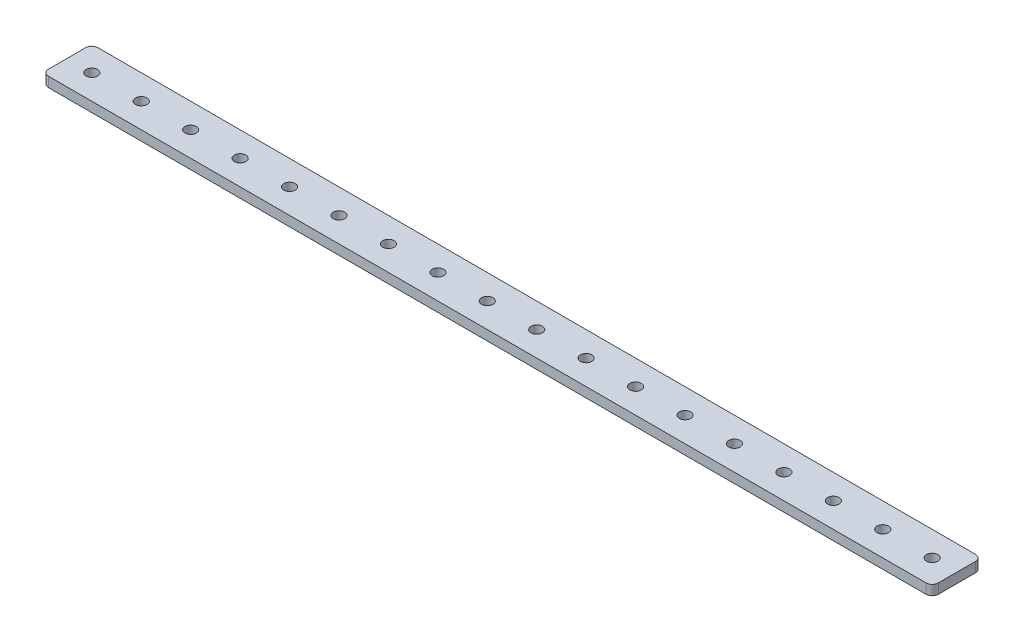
from build123d import *

# Parameters (mm, degrees)
SKETCH1_W          = 288
SKETCH1_H          = 16
EXTRUDE1_DEPTH     = 3.2
SKETCH2_R          = 1.85
CUT_EXTRUDE1_DEPTH = 289.461851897
FILLET1_R          = 2
FILLET2_R          = 2
FILLET3_R          = 2
FILLET4_R          = 2


with BuildPart() as part:
    # Sketch1 → Extrude1 (new body)
    with BuildSketch(Plane(origin=(0, 0, 0), x_dir=(1, 0, 0), z_dir=(0, 1, 0))):
        with Locations((144, 8)):
            Rectangle(SKETCH1_W, SKETCH1_H)
    extrude(amount=EXTRUDE1_DEPTH)

    # Sketch2 → Cut-Extrude1 (cut, through all)
    with BuildSketch(Plane(origin=(0, 3.2, 0), x_dir=(1, 0, 0), z_dir=(0, 1, 0))):
        with Locations(Location((8, 8, 0), (0, 0, 270))):
            Circle(SKETCH2_R)
        with Locations(Location((24, 8, 0), (0, 0, 270))):
            Circle(SKETCH2_R)
        with Locations(Location((40, 8, 0), (0, 0, 270))):
            Circle(SKETCH2_R)
        with Locations(Location((56, 8, 0), (0, 0, 270))):
            Circle(SKETCH2_R)
        with Locations(Location((72, 8, 0), (0, 0, 270))):
            Circle(SKETCH2_R)
        with Locations(Location((88, 8, 0), (0, 0, 270))):
            Circle(SKETCH2_R)
        with Locations(Location((104, 8, 0), (0, 0, 270))):
            Circle(SKETCH2_R)
        with Locations(Location((120, 8, 0), (0, 0, 270))):
            Circle(SKETCH2_R)
        with Locations(Location((136, 8, 0), (0, 0, 270))):
            Circle(SKETCH2_R)
        with Locations(Location((152, 8, 0), (0, 0, 270))):
            Circle(SKETCH2_R)
        with Locations(Location((168, 8, 0), (0, 0, 270))):
            Circle(SKETCH2_R)
        with Locations(Location((184, 8, 0), (0, 0, 270))):
            Circle(SKETCH2_R)
        with Locations(Location((200, 8, 0), (0, 0, 270))):
            Circle(SKETCH2_R)
        with Locations(Location((216, 8, 0), (0, 0, 270))):
            Circle(SKETCH2_R)
        with Locations(Location((232, 8, 0), (0, 0, 270))):
            Circle(SKETCH2_R)
        with Locations(Location((248, 8, 0), (0, 0, 270))):
            Circle(SKETCH2_R)
        with Locations(Location((264, 8, 0), (0, 0, 270))):
            Circle(SKETCH2_R)
        with Locations(Location((280, 8, 0), (0, 0, 270))):
            Circle(SKETCH2_R)
    extrude(amount=-CUT_EXTRUDE1_DEPTH, mode=Mode.SUBTRACT)

    # Fillet1
    fillet1_edges = [part.edges().sort_by_distance(p)[0] for p in [
        (288, 1.6, 0),
    ]]
    fillet(fillet1_edges, radius=FILLET1_R)

    # Fillet2
    fillet2_edges = [part.edges().sort_by_distance(p)[0] for p in [
        (288, 1.6, -16),
    ]]
    fillet(fillet2_edges, radius=FILLET2_R)

    # Fillet3
    fillet3_edges = [part.edges().sort_by_distance(p)[0] for p in [
        (0, 1.6, -16),
    ]]
    fillet(fillet3_edges, radius=FILLET3_R)

    # Fillet4
    fillet4_edges = [part.edges().sort_by_distance(p)[0] for p in [
        (0, 1.6, 0),
    ]]
    fillet(fillet4_edges, radius=FILLET4_R)


solid = part.part
